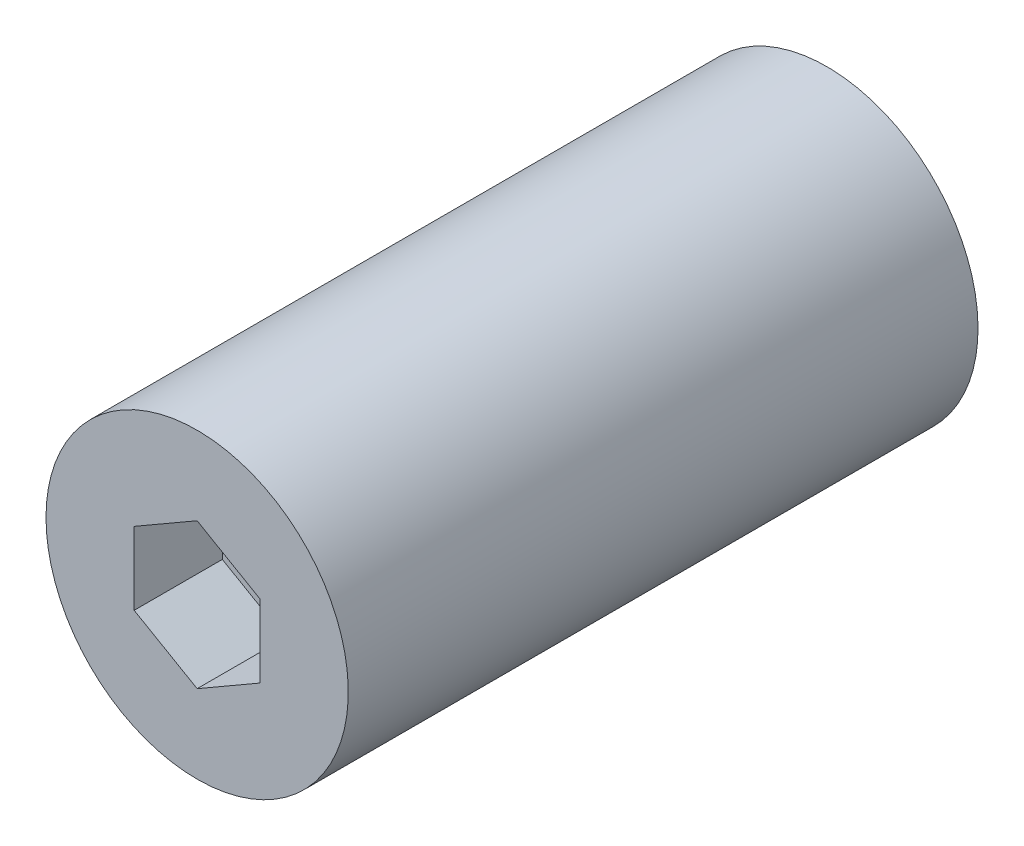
ISO-10303-21;
HEADER;
FILE_DESCRIPTION(('STEP AP214'),'2;1');
FILE_NAME('part.step','',(''),(''),'','','');
FILE_SCHEMA(('AUTOMOTIVE_DESIGN { 1 0 10303 214 1 1 1 1 }'));
ENDSEC;
DATA;
#1=APPLICATION_CONTEXT('core data for automotive mechanical design processes');
#2=APPLICATION_PROTOCOL_DEFINITION('international standard','automotive_design',2000,#1);
#3=PRODUCT_CONTEXT('',#1,'mechanical');
#4=PRODUCT('Part','Part','',(#3));
#5=PRODUCT_RELATED_PRODUCT_CATEGORY('part','',(#4));
#6=PRODUCT_DEFINITION_FORMATION('','',#4);
#7=PRODUCT_DEFINITION_CONTEXT('part definition',#1,'design');
#8=PRODUCT_DEFINITION('design','',#6,#7);
#9=PRODUCT_DEFINITION_SHAPE('','',#8);
#10=(LENGTH_UNIT() NAMED_UNIT(*) SI_UNIT(.MILLI.,.METRE.));
#11=(NAMED_UNIT(*) PLANE_ANGLE_UNIT() SI_UNIT($,.RADIAN.));
#12=(NAMED_UNIT(*) SI_UNIT($,.STERADIAN.) SOLID_ANGLE_UNIT());
#13=UNCERTAINTY_MEASURE_WITH_UNIT(LENGTH_MEASURE(1.E-05),#10,'distance_accuracy_value','');
#14=(GEOMETRIC_REPRESENTATION_CONTEXT(3) GLOBAL_UNCERTAINTY_ASSIGNED_CONTEXT((#13)) GLOBAL_UNIT_ASSIGNED_CONTEXT((#10,
#11,#12)) REPRESENTATION_CONTEXT('',''));
#15=CARTESIAN_POINT('',(0.,0.,0.));
#16=DIRECTION('',(0.,0.,1.));
#17=DIRECTION('',(1.,0.,0.));
#18=AXIS2_PLACEMENT_3D('',#15,#16,#17);
#19=CARTESIAN_POINT('',(0.,0.,25.));
#20=DIRECTION('',(0.,0.,-1.));
#21=DIRECTION('',(0.5,0.866025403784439,0.));
#22=AXIS2_PLACEMENT_3D('',#19,#20,#21);
#23=CYLINDRICAL_SURFACE('',#22,6.);
#24=CARTESIAN_POINT('',(0.,0.,25.));
#25=DIRECTION('',(0.,0.,1.));
#26=DIRECTION('',(-0.5,-0.866025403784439,0.));
#27=AXIS2_PLACEMENT_3D('',#24,#25,#26);
#28=CIRCLE('',#27,6.);
#29=CARTESIAN_POINT('',(-3.,-5.19615242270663,25.));
#30=VERTEX_POINT('',#29);
#31=EDGE_CURVE('E9',#30,#30,#28,.T.);
#32=ORIENTED_EDGE('',*,*,#31,.F.);
#33=EDGE_LOOP('',(#32));
#34=FACE_BOUND('',#33,.T.);
#35=CARTESIAN_POINT('',(0.,0.,0.));
#36=DIRECTION('',(0.,0.,-1.));
#37=DIRECTION('',(-0.866025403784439,0.5,0.));
#38=AXIS2_PLACEMENT_3D('',#35,#36,#37);
#39=CIRCLE('',#38,6.);
#40=CARTESIAN_POINT('',(-5.19615242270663,3.,0.));
#41=VERTEX_POINT('',#40);
#42=EDGE_CURVE('E128',#41,#41,#39,.T.);
#43=ORIENTED_EDGE('',*,*,#42,.F.);
#44=EDGE_LOOP('',(#43));
#45=FACE_BOUND('',#44,.T.);
#46=ADVANCED_FACE('F14',(#34,#45),#23,.T.);
#47=CARTESIAN_POINT('',(0.,0.,25.));
#48=DIRECTION('',(0.,0.,1.));
#49=DIRECTION('',(-0.5,-0.866025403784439,0.));
#50=AXIS2_PLACEMENT_3D('',#47,#48,#49);
#51=PLANE('',#50);
#52=DIRECTION('',(0.866025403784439,0.5,0.));
#53=VECTOR('',#52,1.);
#54=CARTESIAN_POINT('',(0.,-2.88675134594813,25.));
#55=LINE('',#54,#53);
#56=CARTESIAN_POINT('',(0.,-2.88675134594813,25.));
#57=VERTEX_POINT('',#56);
#58=CARTESIAN_POINT('',(2.5,-1.44337567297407,25.));
#59=VERTEX_POINT('',#58);
#60=EDGE_CURVE('E28',#57,#59,#55,.T.);
#61=ORIENTED_EDGE('',*,*,#60,.F.);
#62=DIRECTION('',(0.866025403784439,-0.5,0.));
#63=VECTOR('',#62,1.);
#64=CARTESIAN_POINT('',(-2.5,-1.44337567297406,25.));
#65=LINE('',#64,#63);
#66=CARTESIAN_POINT('',(-2.5,-1.44337567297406,25.));
#67=VERTEX_POINT('',#66);
#68=EDGE_CURVE('E97',#67,#57,#65,.T.);
#69=ORIENTED_EDGE('',*,*,#68,.F.);
#70=DIRECTION('',(0.,-1.,0.));
#71=VECTOR('',#70,1.);
#72=CARTESIAN_POINT('',(-2.5,1.44337567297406,25.));
#73=LINE('',#72,#71);
#74=CARTESIAN_POINT('',(-2.5,1.44337567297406,25.));
#75=VERTEX_POINT('',#74);
#76=EDGE_CURVE('E91',#75,#67,#73,.T.);
#77=ORIENTED_EDGE('',*,*,#76,.F.);
#78=DIRECTION('',(-0.866025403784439,-0.5,0.));
#79=VECTOR('',#78,1.);
#80=CARTESIAN_POINT('',(0.,2.88675134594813,25.));
#81=LINE('',#80,#79);
#82=CARTESIAN_POINT('',(0.,2.88675134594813,25.));
#83=VERTEX_POINT('',#82);
#84=EDGE_CURVE('E89',#83,#75,#81,.T.);
#85=ORIENTED_EDGE('',*,*,#84,.F.);
#86=DIRECTION('',(-0.866025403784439,0.5,0.));
#87=VECTOR('',#86,1.);
#88=CARTESIAN_POINT('',(2.5,1.44337567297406,25.));
#89=LINE('',#88,#87);
#90=CARTESIAN_POINT('',(2.5,1.44337567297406,25.));
#91=VERTEX_POINT('',#90);
#92=EDGE_CURVE('E70',#91,#83,#89,.T.);
#93=ORIENTED_EDGE('',*,*,#92,.F.);
#94=DIRECTION('',(0.,1.,0.));
#95=VECTOR('',#94,1.);
#96=CARTESIAN_POINT('',(2.5,-1.44337567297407,25.));
#97=LINE('',#96,#95);
#98=EDGE_CURVE('E81',#59,#91,#97,.T.);
#99=ORIENTED_EDGE('',*,*,#98,.F.);
#100=EDGE_LOOP('',(#61,#69,#77,#85,#93,#99));
#101=FACE_BOUND('',#100,.T.);
#102=ORIENTED_EDGE('',*,*,#31,.T.);
#103=EDGE_LOOP('',(#102));
#104=FACE_BOUND('',#103,.T.);
#105=ADVANCED_FACE('F85',(#101,#104),#51,.T.);
#106=CARTESIAN_POINT('',(0.,-2.88675134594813,21.5));
#107=DIRECTION('',(0.5,-0.866025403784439,0.));
#108=DIRECTION('',(0.866025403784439,0.5,0.));
#109=AXIS2_PLACEMENT_3D('',#106,#107,#108);
#110=PLANE('',#109);
#111=ORIENTED_EDGE('',*,*,#60,.T.);
#112=DIRECTION('',(0.,0.,1.));
#113=VECTOR('',#112,1.);
#114=CARTESIAN_POINT('',(2.5,-1.44337567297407,21.5));
#115=LINE('',#114,#113);
#116=CARTESIAN_POINT('',(2.5,-1.44337567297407,21.5));
#117=VERTEX_POINT('',#116);
#118=EDGE_CURVE('E78',#117,#59,#115,.T.);
#119=ORIENTED_EDGE('',*,*,#118,.F.);
#120=DIRECTION('',(0.866025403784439,0.5,0.));
#121=VECTOR('',#120,1.);
#122=CARTESIAN_POINT('',(0.,-2.88675134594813,21.5));
#123=LINE('',#122,#121);
#124=CARTESIAN_POINT('',(0.,-2.88675134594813,21.5));
#125=VERTEX_POINT('',#124);
#126=EDGE_CURVE('E99',#125,#117,#123,.T.);
#127=ORIENTED_EDGE('',*,*,#126,.F.);
#128=DIRECTION('',(0.,0.,1.));
#129=VECTOR('',#128,1.);
#130=CARTESIAN_POINT('',(0.,-2.88675134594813,21.5));
#131=LINE('',#130,#129);
#132=EDGE_CURVE('E21',#125,#57,#131,.T.);
#133=ORIENTED_EDGE('',*,*,#132,.T.);
#134=EDGE_LOOP('',(#111,#119,#127,#133));
#135=FACE_BOUND('',#134,.T.);
#136=ADVANCED_FACE('F125',(#135),#110,.F.);
#137=CARTESIAN_POINT('',(-2.5,-1.44337567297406,21.5));
#138=DIRECTION('',(-0.5,-0.866025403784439,0.));
#139=DIRECTION('',(0.866025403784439,-0.5,0.));
#140=AXIS2_PLACEMENT_3D('',#137,#138,#139);
#141=PLANE('',#140);
#142=ORIENTED_EDGE('',*,*,#68,.T.);
#143=ORIENTED_EDGE('',*,*,#132,.F.);
#144=DIRECTION('',(0.866025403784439,-0.5,0.));
#145=VECTOR('',#144,1.);
#146=CARTESIAN_POINT('',(-2.5,-1.44337567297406,21.5));
#147=LINE('',#146,#145);
#148=CARTESIAN_POINT('',(-2.5,-1.44337567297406,21.5));
#149=VERTEX_POINT('',#148);
#150=EDGE_CURVE('E111',#149,#125,#147,.T.);
#151=ORIENTED_EDGE('',*,*,#150,.F.);
#152=DIRECTION('',(0.,0.,1.));
#153=VECTOR('',#152,1.);
#154=CARTESIAN_POINT('',(-2.5,-1.44337567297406,21.5));
#155=LINE('',#154,#153);
#156=EDGE_CURVE('E115',#149,#67,#155,.T.);
#157=ORIENTED_EDGE('',*,*,#156,.T.);
#158=EDGE_LOOP('',(#142,#143,#151,#157));
#159=FACE_BOUND('',#158,.T.);
#160=ADVANCED_FACE('F127',(#159),#141,.F.);
#161=CARTESIAN_POINT('',(-2.5,1.44337567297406,21.5));
#162=DIRECTION('',(-1.,0.,0.));
#163=DIRECTION('',(0.,-1.,0.));
#164=AXIS2_PLACEMENT_3D('',#161,#162,#163);
#165=PLANE('',#164);
#166=ORIENTED_EDGE('',*,*,#76,.T.);
#167=ORIENTED_EDGE('',*,*,#156,.F.);
#168=DIRECTION('',(0.,-1.,0.));
#169=VECTOR('',#168,1.);
#170=CARTESIAN_POINT('',(-2.5,1.44337567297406,21.5));
#171=LINE('',#170,#169);
#172=CARTESIAN_POINT('',(-2.5,1.44337567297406,21.5));
#173=VERTEX_POINT('',#172);
#174=EDGE_CURVE('E108',#173,#149,#171,.T.);
#175=ORIENTED_EDGE('',*,*,#174,.F.);
#176=DIRECTION('',(0.,0.,1.));
#177=VECTOR('',#176,1.);
#178=CARTESIAN_POINT('',(-2.5,1.44337567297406,21.5));
#179=LINE('',#178,#177);
#180=EDGE_CURVE('E117',#173,#75,#179,.T.);
#181=ORIENTED_EDGE('',*,*,#180,.T.);
#182=EDGE_LOOP('',(#166,#167,#175,#181));
#183=FACE_BOUND('',#182,.T.);
#184=ADVANCED_FACE('F155',(#183),#165,.F.);
#185=CARTESIAN_POINT('',(0.,2.88675134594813,21.5));
#186=DIRECTION('',(-0.5,0.866025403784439,0.));
#187=DIRECTION('',(-0.866025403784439,-0.5,0.));
#188=AXIS2_PLACEMENT_3D('',#185,#186,#187);
#189=PLANE('',#188);
#190=ORIENTED_EDGE('',*,*,#84,.T.);
#191=ORIENTED_EDGE('',*,*,#180,.F.);
#192=DIRECTION('',(-0.866025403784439,-0.5,0.));
#193=VECTOR('',#192,1.);
#194=CARTESIAN_POINT('',(0.,2.88675134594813,21.5));
#195=LINE('',#194,#193);
#196=CARTESIAN_POINT('',(0.,2.88675134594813,21.5));
#197=VERTEX_POINT('',#196);
#198=EDGE_CURVE('E105',#197,#173,#195,.T.);
#199=ORIENTED_EDGE('',*,*,#198,.F.);
#200=DIRECTION('',(0.,0.,1.));
#201=VECTOR('',#200,1.);
#202=CARTESIAN_POINT('',(0.,2.88675134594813,21.5));
#203=LINE('',#202,#201);
#204=EDGE_CURVE('E77',#197,#83,#203,.T.);
#205=ORIENTED_EDGE('',*,*,#204,.T.);
#206=EDGE_LOOP('',(#190,#191,#199,#205));
#207=FACE_BOUND('',#206,.T.);
#208=ADVANCED_FACE('F121',(#207),#189,.F.);
#209=CARTESIAN_POINT('',(2.5,1.44337567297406,21.5));
#210=DIRECTION('',(0.5,0.866025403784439,0.));
#211=DIRECTION('',(-0.866025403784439,0.5,0.));
#212=AXIS2_PLACEMENT_3D('',#209,#210,#211);
#213=PLANE('',#212);
#214=ORIENTED_EDGE('',*,*,#92,.T.);
#215=ORIENTED_EDGE('',*,*,#204,.F.);
#216=DIRECTION('',(-0.866025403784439,0.5,0.));
#217=VECTOR('',#216,1.);
#218=CARTESIAN_POINT('',(2.5,1.44337567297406,21.5));
#219=LINE('',#218,#217);
#220=CARTESIAN_POINT('',(2.5,1.44337567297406,21.5));
#221=VERTEX_POINT('',#220);
#222=EDGE_CURVE('E73',#221,#197,#219,.T.);
#223=ORIENTED_EDGE('',*,*,#222,.F.);
#224=DIRECTION('',(0.,0.,1.));
#225=VECTOR('',#224,1.);
#226=CARTESIAN_POINT('',(2.5,1.44337567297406,21.5));
#227=LINE('',#226,#225);
#228=EDGE_CURVE('E66',#221,#91,#227,.T.);
#229=ORIENTED_EDGE('',*,*,#228,.T.);
#230=EDGE_LOOP('',(#214,#215,#223,#229));
#231=FACE_BOUND('',#230,.T.);
#232=ADVANCED_FACE('F68',(#231),#213,.F.);
#233=CARTESIAN_POINT('',(2.5,-1.44337567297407,21.5));
#234=DIRECTION('',(1.,0.,0.));
#235=DIRECTION('',(0.,1.,0.));
#236=AXIS2_PLACEMENT_3D('',#233,#234,#235);
#237=PLANE('',#236);
#238=ORIENTED_EDGE('',*,*,#98,.T.);
#239=ORIENTED_EDGE('',*,*,#228,.F.);
#240=DIRECTION('',(0.,1.,0.));
#241=VECTOR('',#240,1.);
#242=CARTESIAN_POINT('',(2.5,-1.44337567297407,21.5));
#243=LINE('',#242,#241);
#244=EDGE_CURVE('E102',#117,#221,#243,.T.);
#245=ORIENTED_EDGE('',*,*,#244,.F.);
#246=ORIENTED_EDGE('',*,*,#118,.T.);
#247=EDGE_LOOP('',(#238,#239,#245,#246));
#248=FACE_BOUND('',#247,.T.);
#249=ADVANCED_FACE('F82',(#248),#237,.F.);
#250=CARTESIAN_POINT('',(5.,0.,21.5));
#251=DIRECTION('',(0.,0.,1.));
#252=DIRECTION('',(-0.5,-0.866025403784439,0.));
#253=AXIS2_PLACEMENT_3D('',#250,#251,#252);
#254=PLANE('',#253);
#255=ORIENTED_EDGE('',*,*,#126,.T.);
#256=ORIENTED_EDGE('',*,*,#244,.T.);
#257=ORIENTED_EDGE('',*,*,#222,.T.);
#258=ORIENTED_EDGE('',*,*,#198,.T.);
#259=ORIENTED_EDGE('',*,*,#174,.T.);
#260=ORIENTED_EDGE('',*,*,#150,.T.);
#261=EDGE_LOOP('',(#255,#256,#257,#258,#259,#260));
#262=FACE_BOUND('',#261,.T.);
#263=ADVANCED_FACE('F124',(#262),#254,.T.);
#264=CARTESIAN_POINT('',(0.,0.,0.));
#265=DIRECTION('',(0.,0.,-1.));
#266=DIRECTION('',(-0.866025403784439,0.5,0.));
#267=AXIS2_PLACEMENT_3D('',#264,#265,#266);
#268=PLANE('',#267);
#269=ORIENTED_EDGE('',*,*,#42,.T.);
#270=EDGE_LOOP('',(#269));
#271=FACE_BOUND('',#270,.T.);
#272=ADVANCED_FACE('F133',(#271),#268,.T.);
#273=CLOSED_SHELL('',(#46,#105,#136,#160,#184,#208,#232,#249,#263,#272));
#274=MANIFOLD_SOLID_BREP('B1',#273);
#275=ADVANCED_BREP_SHAPE_REPRESENTATION('',(#18,#274),#14);
#276=SHAPE_DEFINITION_REPRESENTATION(#9,#275);
ENDSEC;
END-ISO-10303-21;
